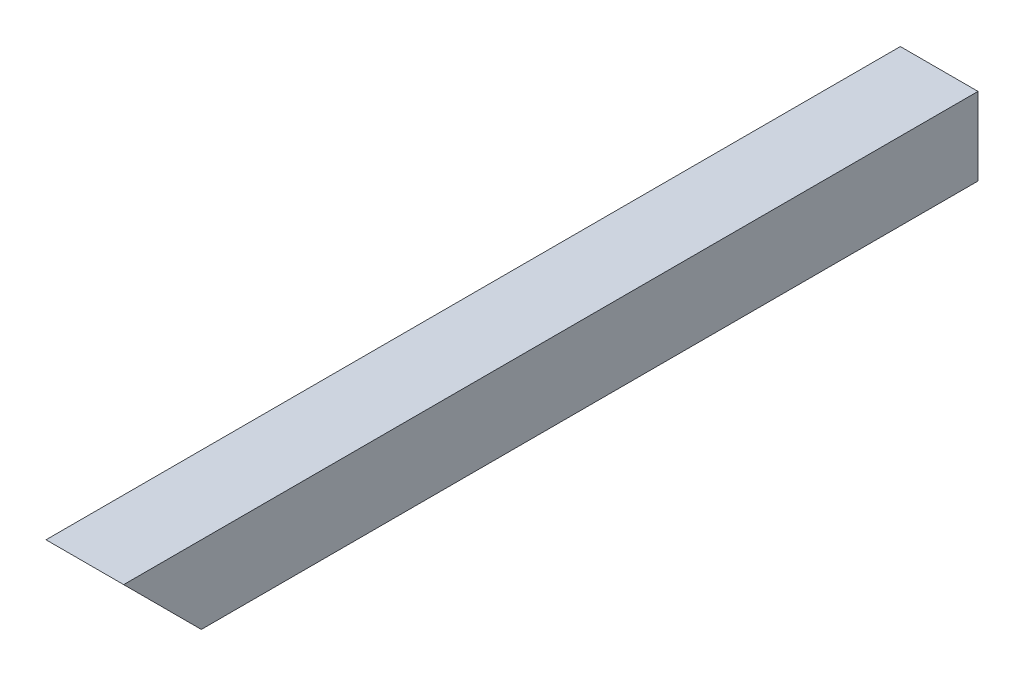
ISO-10303-21;
HEADER;
FILE_DESCRIPTION(('STEP AP214'),'2;1');
FILE_NAME('part.step','',(''),(''),'','','');
FILE_SCHEMA(('AUTOMOTIVE_DESIGN { 1 0 10303 214 1 1 1 1 }'));
ENDSEC;
DATA;
#1=APPLICATION_CONTEXT('core data for automotive mechanical design processes');
#2=APPLICATION_PROTOCOL_DEFINITION('international standard','automotive_design',2000,#1);
#3=PRODUCT_CONTEXT('',#1,'mechanical');
#4=PRODUCT('Part','Part','',(#3));
#5=PRODUCT_RELATED_PRODUCT_CATEGORY('part','',(#4));
#6=PRODUCT_DEFINITION_FORMATION('','',#4);
#7=PRODUCT_DEFINITION_CONTEXT('part definition',#1,'design');
#8=PRODUCT_DEFINITION('design','',#6,#7);
#9=PRODUCT_DEFINITION_SHAPE('','',#8);
#10=(LENGTH_UNIT() NAMED_UNIT(*) SI_UNIT(.MILLI.,.METRE.));
#11=(NAMED_UNIT(*) PLANE_ANGLE_UNIT() SI_UNIT($,.RADIAN.));
#12=(NAMED_UNIT(*) SI_UNIT($,.STERADIAN.) SOLID_ANGLE_UNIT());
#13=UNCERTAINTY_MEASURE_WITH_UNIT(LENGTH_MEASURE(1.E-05),#10,'distance_accuracy_value','');
#14=(GEOMETRIC_REPRESENTATION_CONTEXT(3) GLOBAL_UNCERTAINTY_ASSIGNED_CONTEXT((#13)) GLOBAL_UNIT_ASSIGNED_CONTEXT((#10,
#11,#12)) REPRESENTATION_CONTEXT('',''));
#15=CARTESIAN_POINT('',(0.,0.,0.));
#16=DIRECTION('',(0.,0.,1.));
#17=DIRECTION('',(1.,0.,0.));
#18=AXIS2_PLACEMENT_3D('',#15,#16,#17);
#19=CARTESIAN_POINT('',(0.,0.,0.));
#20=DIRECTION('',(0.,0.,1.));
#21=DIRECTION('',(1.,0.,0.));
#22=AXIS2_PLACEMENT_3D('',#19,#20,#21);
#23=PLANE('',#22);
#24=DIRECTION('',(0.,1.,0.));
#25=VECTOR('',#24,1.);
#26=CARTESIAN_POINT('',(15.,-15.0000000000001,-2.22044604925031E-13));
#27=LINE('',#26,#25);
#28=CARTESIAN_POINT('',(15.,-15.0000000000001,-2.22044604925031E-13));
#29=VERTEX_POINT('',#28);
#30=CARTESIAN_POINT('',(15.,15.,-6.66133814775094E-13));
#31=VERTEX_POINT('',#30);
#32=EDGE_CURVE('E157',#29,#31,#27,.T.);
#33=ORIENTED_EDGE('',*,*,#32,.F.);
#34=DIRECTION('',(1.,0.,0.));
#35=VECTOR('',#34,1.);
#36=CARTESIAN_POINT('',(-15.,-15.0000000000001,0.));
#37=LINE('',#36,#35);
#38=CARTESIAN_POINT('',(-15.,-15.0000000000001,0.));
#39=VERTEX_POINT('',#38);
#40=EDGE_CURVE('E161',#39,#29,#37,.T.);
#41=ORIENTED_EDGE('',*,*,#40,.F.);
#42=DIRECTION('',(0.,-1.,0.));
#43=VECTOR('',#42,1.);
#44=CARTESIAN_POINT('',(-15.,-15.0000000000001,0.));
#45=LINE('',#44,#43);
#46=CARTESIAN_POINT('',(-15.0000000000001,15.,-2.22044604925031E-13));
#47=VERTEX_POINT('',#46);
#48=EDGE_CURVE('E166',#47,#39,#45,.T.);
#49=ORIENTED_EDGE('',*,*,#48,.F.);
#50=DIRECTION('',(-1.,0.,0.));
#51=VECTOR('',#50,1.);
#52=CARTESIAN_POINT('',(-15.0000000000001,15.,-2.22044604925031E-13));
#53=LINE('',#52,#51);
#54=EDGE_CURVE('E164',#31,#47,#53,.T.);
#55=ORIENTED_EDGE('',*,*,#54,.F.);
#56=EDGE_LOOP('',(#33,#41,#49,#55));
#57=FACE_BOUND('',#56,.T.);
#58=DIRECTION('',(0.,1.,0.));
#59=VECTOR('',#58,1.);
#60=CARTESIAN_POINT('',(13.,0.,-4.44089209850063E-13));
#61=LINE('',#60,#59);
#62=CARTESIAN_POINT('',(12.9999999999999,-13.,-2.22044604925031E-13));
#63=VERTEX_POINT('',#62);
#64=CARTESIAN_POINT('',(13.,13.,-6.66133814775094E-13));
#65=VERTEX_POINT('',#64);
#66=EDGE_CURVE('E196',#63,#65,#61,.T.);
#67=ORIENTED_EDGE('',*,*,#66,.T.);
#68=DIRECTION('',(-1.,0.,0.));
#69=VECTOR('',#68,1.);
#70=CARTESIAN_POINT('',(0.,12.9999999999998,-2.22044604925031E-13));
#71=LINE('',#70,#69);
#72=CARTESIAN_POINT('',(-13.,12.9999999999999,0.));
#73=VERTEX_POINT('',#72);
#74=EDGE_CURVE('E199',#65,#73,#71,.T.);
#75=ORIENTED_EDGE('',*,*,#74,.T.);
#76=DIRECTION('',(0.,-1.,0.));
#77=VECTOR('',#76,1.);
#78=CARTESIAN_POINT('',(-13.0000000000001,0.,0.));
#79=LINE('',#78,#77);
#80=CARTESIAN_POINT('',(-13.,-13.0000000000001,0.));
#81=VERTEX_POINT('',#80);
#82=EDGE_CURVE('E202',#73,#81,#79,.T.);
#83=ORIENTED_EDGE('',*,*,#82,.T.);
#84=DIRECTION('',(1.,0.,0.));
#85=VECTOR('',#84,1.);
#86=CARTESIAN_POINT('',(0.,-13.,0.));
#87=LINE('',#86,#85);
#88=EDGE_CURVE('E147',#81,#63,#87,.T.);
#89=ORIENTED_EDGE('',*,*,#88,.T.);
#90=EDGE_LOOP('',(#67,#75,#83,#89));
#91=FACE_BOUND('',#90,.T.);
#92=ADVANCED_FACE('F64',(#57,#91),#23,.F.);
#93=CARTESIAN_POINT('',(14.9999999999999,-15.0000000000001,330.000000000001));
#94=DIRECTION('',(-1.,0.,0.));
#95=DIRECTION('',(0.,0.,1.));
#96=AXIS2_PLACEMENT_3D('',#93,#94,#95);
#97=PLANE('',#96);
#98=DIRECTION('',(0.,0.,-1.));
#99=VECTOR('',#98,1.);
#100=CARTESIAN_POINT('',(14.9999999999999,15.,330.));
#101=LINE('',#100,#99);
#102=CARTESIAN_POINT('',(14.9999999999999,15.,330.));
#103=VERTEX_POINT('',#102);
#104=EDGE_CURVE('E12',#103,#31,#101,.T.);
#105=ORIENTED_EDGE('',*,*,#104,.F.);
#106=DIRECTION('',(0.,0.70710678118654,0.707106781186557));
#107=VECTOR('',#106,1.);
#108=CARTESIAN_POINT('',(14.9999999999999,15.,330.));
#109=LINE('',#108,#107);
#110=CARTESIAN_POINT('',(14.9999999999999,-15.,300.));
#111=VERTEX_POINT('',#110);
#112=EDGE_CURVE('E189',#111,#103,#109,.T.);
#113=ORIENTED_EDGE('',*,*,#112,.F.);
#114=DIRECTION('',(0.,0.,-1.));
#115=VECTOR('',#114,1.);
#116=CARTESIAN_POINT('',(14.9999999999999,-15.0000000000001,330.000000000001));
#117=LINE('',#116,#115);
#118=EDGE_CURVE('E160',#111,#29,#117,.T.);
#119=ORIENTED_EDGE('',*,*,#118,.T.);
#120=ORIENTED_EDGE('',*,*,#32,.T.);
#121=EDGE_LOOP('',(#105,#113,#119,#120));
#122=FACE_BOUND('',#121,.T.);
#123=ADVANCED_FACE('F66',(#122),#97,.F.);
#124=CARTESIAN_POINT('',(-15.0000000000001,15.,330.000000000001));
#125=DIRECTION('',(0.,-1.,0.));
#126=DIRECTION('',(0.,0.,-1.));
#127=AXIS2_PLACEMENT_3D('',#124,#125,#126);
#128=PLANE('',#127);
#129=ORIENTED_EDGE('',*,*,#54,.T.);
#130=DIRECTION('',(0.,0.,-1.));
#131=VECTOR('',#130,1.);
#132=CARTESIAN_POINT('',(-15.0000000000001,15.,330.000000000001));
#133=LINE('',#132,#131);
#134=CARTESIAN_POINT('',(-15.0000000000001,15.,330.000000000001));
#135=VERTEX_POINT('',#134);
#136=EDGE_CURVE('E72',#135,#47,#133,.T.);
#137=ORIENTED_EDGE('',*,*,#136,.F.);
#138=DIRECTION('',(-1.,0.,0.));
#139=VECTOR('',#138,1.);
#140=CARTESIAN_POINT('',(-15.0000000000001,15.,330.000000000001));
#141=LINE('',#140,#139);
#142=EDGE_CURVE('E158',#103,#135,#141,.T.);
#143=ORIENTED_EDGE('',*,*,#142,.F.);
#144=ORIENTED_EDGE('',*,*,#104,.T.);
#145=EDGE_LOOP('',(#129,#137,#143,#144));
#146=FACE_BOUND('',#145,.T.);
#147=ADVANCED_FACE('F223',(#146),#128,.F.);
#148=CARTESIAN_POINT('',(-15.0000000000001,-15.0000000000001,330.));
#149=DIRECTION('',(1.,0.,0.));
#150=DIRECTION('',(0.,0.,-1.));
#151=AXIS2_PLACEMENT_3D('',#148,#149,#150);
#152=PLANE('',#151);
#153=DIRECTION('',(0.,0.,-1.));
#154=VECTOR('',#153,1.);
#155=CARTESIAN_POINT('',(-15.0000000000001,-15.0000000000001,330.));
#156=LINE('',#155,#154);
#157=CARTESIAN_POINT('',(-15.0000000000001,-15.0000000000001,300.));
#158=VERTEX_POINT('',#157);
#159=EDGE_CURVE('E172',#158,#39,#156,.T.);
#160=ORIENTED_EDGE('',*,*,#159,.F.);
#161=DIRECTION('',(0.,-0.70710678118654,-0.707106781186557));
#162=VECTOR('',#161,1.);
#163=CARTESIAN_POINT('',(-15.0000000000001,15.,330.000000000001));
#164=LINE('',#163,#162);
#165=EDGE_CURVE('E79',#135,#158,#164,.T.);
#166=ORIENTED_EDGE('',*,*,#165,.F.);
#167=ORIENTED_EDGE('',*,*,#136,.T.);
#168=ORIENTED_EDGE('',*,*,#48,.T.);
#169=EDGE_LOOP('',(#160,#166,#167,#168));
#170=FACE_BOUND('',#169,.T.);
#171=ADVANCED_FACE('F178',(#170),#152,.F.);
#172=CARTESIAN_POINT('',(-15.0000000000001,-15.0000000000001,330.));
#173=DIRECTION('',(0.,1.,0.));
#174=DIRECTION('',(0.,0.,1.));
#175=AXIS2_PLACEMENT_3D('',#172,#173,#174);
#176=PLANE('',#175);
#177=ORIENTED_EDGE('',*,*,#118,.F.);
#178=DIRECTION('',(1.,0.,0.));
#179=VECTOR('',#178,1.);
#180=CARTESIAN_POINT('',(-15.0010000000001,-15.,299.999999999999));
#181=LINE('',#180,#179);
#182=EDGE_CURVE('E134',#158,#111,#181,.T.);
#183=ORIENTED_EDGE('',*,*,#182,.F.);
#184=ORIENTED_EDGE('',*,*,#159,.T.);
#185=ORIENTED_EDGE('',*,*,#40,.T.);
#186=EDGE_LOOP('',(#177,#183,#184,#185));
#187=FACE_BOUND('',#186,.T.);
#188=ADVANCED_FACE('F187',(#187),#176,.F.);
#189=CARTESIAN_POINT('',(12.9999999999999,0.,330.));
#190=DIRECTION('',(-1.,0.,0.));
#191=DIRECTION('',(0.,0.,1.));
#192=AXIS2_PLACEMENT_3D('',#189,#190,#191);
#193=PLANE('',#192);
#194=DIRECTION('',(0.,0.70710678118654,0.707106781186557));
#195=VECTOR('',#194,1.);
#196=CARTESIAN_POINT('',(12.9999999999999,15.,330.));
#197=LINE('',#196,#195);
#198=CARTESIAN_POINT('',(12.9999999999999,-13.,302.));
#199=VERTEX_POINT('',#198);
#200=CARTESIAN_POINT('',(12.9999999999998,13.,328.));
#201=VERTEX_POINT('',#200);
#202=EDGE_CURVE('E87',#199,#201,#197,.T.);
#203=ORIENTED_EDGE('',*,*,#202,.T.);
#204=DIRECTION('',(0.,0.,-1.));
#205=VECTOR('',#204,1.);
#206=CARTESIAN_POINT('',(12.9999999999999,13.0000000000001,330.));
#207=LINE('',#206,#205);
#208=EDGE_CURVE('E151',#201,#65,#207,.T.);
#209=ORIENTED_EDGE('',*,*,#208,.T.);
#210=ORIENTED_EDGE('',*,*,#66,.F.);
#211=DIRECTION('',(0.,0.,-1.));
#212=VECTOR('',#211,1.);
#213=CARTESIAN_POINT('',(12.9999999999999,-13.0000000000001,330.000000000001));
#214=LINE('',#213,#212);
#215=EDGE_CURVE('E149',#199,#63,#214,.T.);
#216=ORIENTED_EDGE('',*,*,#215,.F.);
#217=EDGE_LOOP('',(#203,#209,#210,#216));
#218=FACE_BOUND('',#217,.T.);
#219=ADVANCED_FACE('F209',(#218),#193,.T.);
#220=CARTESIAN_POINT('',(0.,12.9999999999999,330.000000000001));
#221=DIRECTION('',(0.,-1.,0.));
#222=DIRECTION('',(0.,0.,-1.));
#223=AXIS2_PLACEMENT_3D('',#220,#221,#222);
#224=PLANE('',#223);
#225=DIRECTION('',(-1.,0.,0.));
#226=VECTOR('',#225,1.);
#227=CARTESIAN_POINT('',(-15.0010000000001,13.,328.));
#228=LINE('',#227,#226);
#229=CARTESIAN_POINT('',(-13.0000000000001,13.,328.000000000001));
#230=VERTEX_POINT('',#229);
#231=EDGE_CURVE('E143',#201,#230,#228,.T.);
#232=ORIENTED_EDGE('',*,*,#231,.T.);
#233=DIRECTION('',(0.,0.,-1.));
#234=VECTOR('',#233,1.);
#235=CARTESIAN_POINT('',(-13.0000000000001,12.9999999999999,330.000000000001));
#236=LINE('',#235,#234);
#237=EDGE_CURVE('E142',#230,#73,#236,.T.);
#238=ORIENTED_EDGE('',*,*,#237,.T.);
#239=ORIENTED_EDGE('',*,*,#74,.F.);
#240=ORIENTED_EDGE('',*,*,#208,.F.);
#241=EDGE_LOOP('',(#232,#238,#239,#240));
#242=FACE_BOUND('',#241,.T.);
#243=ADVANCED_FACE('F207',(#242),#224,.T.);
#244=CARTESIAN_POINT('',(-13.0000000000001,0.,330.));
#245=DIRECTION('',(1.,0.,0.));
#246=DIRECTION('',(0.,0.,-1.));
#247=AXIS2_PLACEMENT_3D('',#244,#245,#246);
#248=PLANE('',#247);
#249=DIRECTION('',(0.,-0.70710678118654,-0.707106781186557));
#250=VECTOR('',#249,1.);
#251=CARTESIAN_POINT('',(-13.0000000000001,14.9999999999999,330.));
#252=LINE('',#251,#250);
#253=CARTESIAN_POINT('',(-13.0000000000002,-13.,302.));
#254=VERTEX_POINT('',#253);
#255=EDGE_CURVE('E129',#230,#254,#252,.T.);
#256=ORIENTED_EDGE('',*,*,#255,.T.);
#257=DIRECTION('',(0.,0.,-1.));
#258=VECTOR('',#257,1.);
#259=CARTESIAN_POINT('',(-13.0000000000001,-13.0000000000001,330.));
#260=LINE('',#259,#258);
#261=EDGE_CURVE('E140',#254,#81,#260,.T.);
#262=ORIENTED_EDGE('',*,*,#261,.T.);
#263=ORIENTED_EDGE('',*,*,#82,.F.);
#264=ORIENTED_EDGE('',*,*,#237,.F.);
#265=EDGE_LOOP('',(#256,#262,#263,#264));
#266=FACE_BOUND('',#265,.T.);
#267=ADVANCED_FACE('F138',(#266),#248,.T.);
#268=CARTESIAN_POINT('',(0.,-13.0000000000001,330.));
#269=DIRECTION('',(0.,1.,0.));
#270=DIRECTION('',(0.,0.,1.));
#271=AXIS2_PLACEMENT_3D('',#268,#269,#270);
#272=PLANE('',#271);
#273=DIRECTION('',(1.,0.,0.));
#274=VECTOR('',#273,1.);
#275=CARTESIAN_POINT('',(-15.0010000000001,-13.0000000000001,301.999999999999));
#276=LINE('',#275,#274);
#277=EDGE_CURVE('E126',#254,#199,#276,.T.);
#278=ORIENTED_EDGE('',*,*,#277,.T.);
#279=ORIENTED_EDGE('',*,*,#215,.T.);
#280=ORIENTED_EDGE('',*,*,#88,.F.);
#281=ORIENTED_EDGE('',*,*,#261,.F.);
#282=EDGE_LOOP('',(#278,#279,#280,#281));
#283=FACE_BOUND('',#282,.T.);
#284=ADVANCED_FACE('F145',(#283),#272,.T.);
#285=CARTESIAN_POINT('',(-15.0010000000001,15.,330.));
#286=DIRECTION('',(0.,0.707106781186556,-0.707106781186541));
#287=DIRECTION('',(0.,0.70710678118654,0.707106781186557));
#288=AXIS2_PLACEMENT_3D('',#285,#286,#287);
#289=PLANE('',#288);
#290=ORIENTED_EDGE('',*,*,#277,.F.);
#291=ORIENTED_EDGE('',*,*,#255,.F.);
#292=ORIENTED_EDGE('',*,*,#231,.F.);
#293=ORIENTED_EDGE('',*,*,#202,.F.);
#294=EDGE_LOOP('',(#290,#291,#292,#293));
#295=FACE_BOUND('',#294,.T.);
#296=ORIENTED_EDGE('',*,*,#165,.T.);
#297=ORIENTED_EDGE('',*,*,#182,.T.);
#298=ORIENTED_EDGE('',*,*,#112,.T.);
#299=ORIENTED_EDGE('',*,*,#142,.T.);
#300=EDGE_LOOP('',(#296,#297,#298,#299));
#301=FACE_BOUND('',#300,.T.);
#302=ADVANCED_FACE('F128',(#295,#301),#289,.F.);
#303=CLOSED_SHELL('',(#92,#123,#147,#171,#188,#219,#243,#267,#284,#302));
#304=MANIFOLD_SOLID_BREP('B2',#303);
#305=ADVANCED_BREP_SHAPE_REPRESENTATION('',(#18,#304),#14);
#306=SHAPE_DEFINITION_REPRESENTATION(#9,#305);
ENDSEC;
END-ISO-10303-21;
